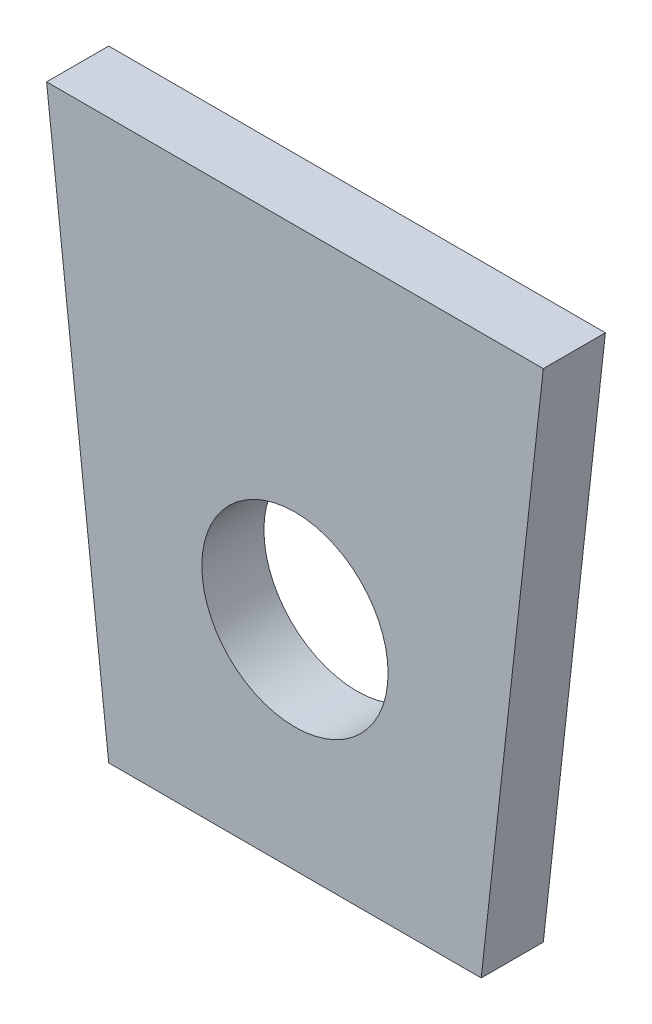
from build123d import *

# Parameters (mm, degrees)
SKETCH_1_R      = 15
EXTRUDE_1_DEPTH = 10


with BuildPart() as part:
    # Sketch 1 → Extrude 1 (new body)
    with BuildSketch(Plane.XY):
        Polygon((-40, 0), (40, 0), (30, -90), (-30, -90), align=None)
        with Locations((0, -55)):
            Circle(SKETCH_1_R, mode=Mode.SUBTRACT)
    extrude(amount=EXTRUDE_1_DEPTH)


solid = part.part
